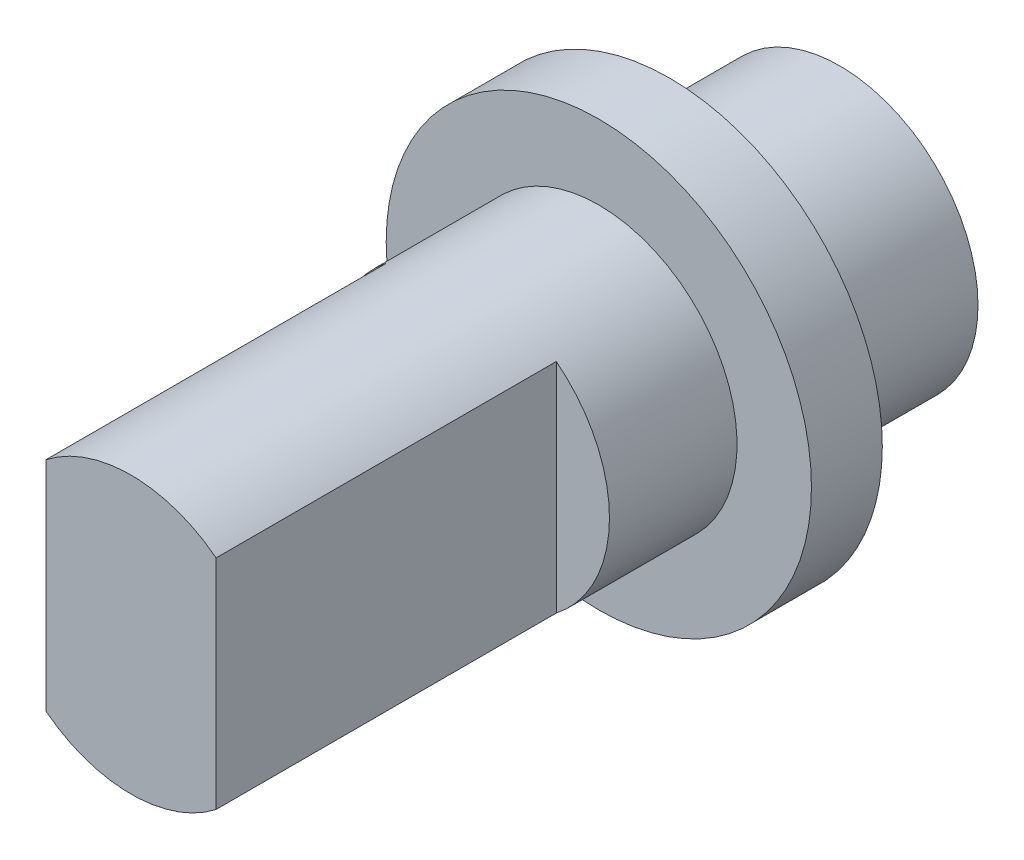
ISO-10303-21;
HEADER;
FILE_DESCRIPTION(('STEP AP214'),'2;1');
FILE_NAME('part.step','',(''),(''),'','','');
FILE_SCHEMA(('AUTOMOTIVE_DESIGN { 1 0 10303 214 1 1 1 1 }'));
ENDSEC;
DATA;
#1=APPLICATION_CONTEXT('core data for automotive mechanical design processes');
#2=APPLICATION_PROTOCOL_DEFINITION('international standard','automotive_design',2000,#1);
#3=PRODUCT_CONTEXT('',#1,'mechanical');
#4=PRODUCT('Part','Part','',(#3));
#5=PRODUCT_RELATED_PRODUCT_CATEGORY('part','',(#4));
#6=PRODUCT_DEFINITION_FORMATION('','',#4);
#7=PRODUCT_DEFINITION_CONTEXT('part definition',#1,'design');
#8=PRODUCT_DEFINITION('design','',#6,#7);
#9=PRODUCT_DEFINITION_SHAPE('','',#8);
#10=(LENGTH_UNIT() NAMED_UNIT(*) SI_UNIT(.MILLI.,.METRE.));
#11=(NAMED_UNIT(*) PLANE_ANGLE_UNIT() SI_UNIT($,.RADIAN.));
#12=(NAMED_UNIT(*) SI_UNIT($,.STERADIAN.) SOLID_ANGLE_UNIT());
#13=UNCERTAINTY_MEASURE_WITH_UNIT(LENGTH_MEASURE(1.E-05),#10,'distance_accuracy_value','');
#14=(GEOMETRIC_REPRESENTATION_CONTEXT(3) GLOBAL_UNCERTAINTY_ASSIGNED_CONTEXT((#13)) GLOBAL_UNIT_ASSIGNED_CONTEXT((#10,
#11,#12)) REPRESENTATION_CONTEXT('',''));
#15=CARTESIAN_POINT('',(0.,0.,0.));
#16=DIRECTION('',(0.,0.,1.));
#17=DIRECTION('',(1.,0.,0.));
#18=AXIS2_PLACEMENT_3D('',#15,#16,#17);
#19=CARTESIAN_POINT('',(0.,0.,12.7));
#20=DIRECTION('',(0.,0.,-1.));
#21=DIRECTION('',(-1.,0.,0.));
#22=AXIS2_PLACEMENT_3D('',#19,#20,#21);
#23=CYLINDRICAL_SURFACE('',#22,2.4765);
#24=CARTESIAN_POINT('',(0.,0.,12.7));
#25=DIRECTION('',(0.,0.,1.));
#26=DIRECTION('',(1.,0.,0.));
#27=AXIS2_PLACEMENT_3D('',#24,#25,#26);
#28=CIRCLE('',#27,2.4765);
#29=CARTESIAN_POINT('',(-1.524,-1.9520441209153,12.7));
#30=VERTEX_POINT('',#29);
#31=CARTESIAN_POINT('',(1.524,-1.9520441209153,12.7));
#32=VERTEX_POINT('',#31);
#33=EDGE_CURVE('E88',#30,#32,#28,.T.);
#34=ORIENTED_EDGE('',*,*,#33,.F.);
#35=DIRECTION('',(0.,0.,-1.));
#36=VECTOR('',#35,1.);
#37=CARTESIAN_POINT('',(-1.524,-1.9520441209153,12.7));
#38=LINE('',#37,#36);
#39=CARTESIAN_POINT('',(-1.524,-1.9520441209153,6.604));
#40=VERTEX_POINT('',#39);
#41=EDGE_CURVE('E47',#30,#40,#38,.T.);
#42=ORIENTED_EDGE('',*,*,#41,.T.);
#43=CARTESIAN_POINT('',(0.,0.,6.604));
#44=DIRECTION('',(0.,0.,1.));
#45=DIRECTION('',(1.,0.,0.));
#46=AXIS2_PLACEMENT_3D('',#43,#44,#45);
#47=CIRCLE('',#46,2.4765);
#48=CARTESIAN_POINT('',(-1.524,1.9520441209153,6.604));
#49=VERTEX_POINT('',#48);
#50=EDGE_CURVE('E102',#49,#40,#47,.T.);
#51=ORIENTED_EDGE('',*,*,#50,.F.);
#52=DIRECTION('',(0.,0.,-1.));
#53=VECTOR('',#52,1.);
#54=CARTESIAN_POINT('',(-1.524,1.9520441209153,12.7));
#55=LINE('',#54,#53);
#56=CARTESIAN_POINT('',(-1.524,1.9520441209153,12.7));
#57=VERTEX_POINT('',#56);
#58=EDGE_CURVE('E221',#49,#57,#55,.F.);
#59=ORIENTED_EDGE('',*,*,#58,.T.);
#60=CARTESIAN_POINT('',(1.524,1.9520441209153,12.7));
#61=VERTEX_POINT('',#60);
#62=EDGE_CURVE('E82',#61,#57,#28,.T.);
#63=ORIENTED_EDGE('',*,*,#62,.F.);
#64=DIRECTION('',(0.,0.,-1.));
#65=VECTOR('',#64,1.);
#66=CARTESIAN_POINT('',(1.524,1.9520441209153,12.7));
#67=LINE('',#66,#65);
#68=CARTESIAN_POINT('',(1.524,1.9520441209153,6.604));
#69=VERTEX_POINT('',#68);
#70=EDGE_CURVE('E55',#61,#69,#67,.T.);
#71=ORIENTED_EDGE('',*,*,#70,.T.);
#72=CARTESIAN_POINT('',(0.,0.,6.604));
#73=DIRECTION('',(0.,0.,1.));
#74=DIRECTION('',(1.,0.,0.));
#75=AXIS2_PLACEMENT_3D('',#72,#73,#74);
#76=CIRCLE('',#75,2.4765);
#77=CARTESIAN_POINT('',(1.524,-1.9520441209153,6.604));
#78=VERTEX_POINT('',#77);
#79=EDGE_CURVE('E89',#78,#69,#76,.T.);
#80=ORIENTED_EDGE('',*,*,#79,.F.);
#81=DIRECTION('',(0.,0.,-1.));
#82=VECTOR('',#81,1.);
#83=CARTESIAN_POINT('',(1.524,-1.9520441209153,12.7));
#84=LINE('',#83,#82);
#85=EDGE_CURVE('E75',#78,#32,#84,.F.);
#86=ORIENTED_EDGE('',*,*,#85,.T.);
#87=EDGE_LOOP('',(#34,#42,#51,#59,#63,#71,#80,#86));
#88=FACE_BOUND('',#87,.T.);
#89=CARTESIAN_POINT('',(0.,0.,4.318));
#90=DIRECTION('',(0.,0.,-1.));
#91=DIRECTION('',(0.,1.,0.));
#92=AXIS2_PLACEMENT_3D('',#89,#90,#91);
#93=CIRCLE('',#92,2.4765);
#94=CARTESIAN_POINT('',(0.,2.4765,4.318));
#95=VERTEX_POINT('',#94);
#96=EDGE_CURVE('E11',#95,#95,#93,.T.);
#97=ORIENTED_EDGE('',*,*,#96,.F.);
#98=EDGE_LOOP('',(#97));
#99=FACE_BOUND('',#98,.T.);
#100=ADVANCED_FACE('F33',(#88,#99),#23,.T.);
#101=CARTESIAN_POINT('',(0.,0.,12.7));
#102=DIRECTION('',(0.,0.,1.));
#103=DIRECTION('',(1.,0.,0.));
#104=AXIS2_PLACEMENT_3D('',#101,#102,#103);
#105=PLANE('',#104);
#106=DIRECTION('',(0.,1.,0.));
#107=VECTOR('',#106,1.);
#108=CARTESIAN_POINT('',(-1.524,0.,12.7));
#109=LINE('',#108,#107);
#110=EDGE_CURVE('E81',#30,#57,#109,.T.);
#111=ORIENTED_EDGE('',*,*,#110,.F.);
#112=ORIENTED_EDGE('',*,*,#33,.T.);
#113=DIRECTION('',(0.,-1.,0.));
#114=VECTOR('',#113,1.);
#115=CARTESIAN_POINT('',(1.524,0.,12.7));
#116=LINE('',#115,#114);
#117=EDGE_CURVE('E72',#61,#32,#116,.T.);
#118=ORIENTED_EDGE('',*,*,#117,.F.);
#119=ORIENTED_EDGE('',*,*,#62,.T.);
#120=EDGE_LOOP('',(#111,#112,#118,#119));
#121=FACE_BOUND('',#120,.T.);
#122=ADVANCED_FACE('F92',(#121),#105,.T.);
#123=CARTESIAN_POINT('',(0.,0.,6.604));
#124=DIRECTION('',(0.,0.,1.));
#125=DIRECTION('',(1.,0.,0.));
#126=AXIS2_PLACEMENT_3D('',#123,#124,#125);
#127=PLANE('',#126);
#128=ORIENTED_EDGE('',*,*,#79,.T.);
#129=DIRECTION('',(0.,-1.,0.));
#130=VECTOR('',#129,1.);
#131=CARTESIAN_POINT('',(1.524,2.1406151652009,6.604));
#132=LINE('',#131,#130);
#133=EDGE_CURVE('E215',#69,#78,#132,.T.);
#134=ORIENTED_EDGE('',*,*,#133,.T.);
#135=EDGE_LOOP('',(#128,#134));
#136=FACE_BOUND('',#135,.T.);
#137=ADVANCED_FACE('F124',(#136),#127,.T.);
#138=CARTESIAN_POINT('',(1.524,2.1406151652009,6.604));
#139=DIRECTION('',(-1.,0.,0.));
#140=DIRECTION('',(0.,-1.,0.));
#141=AXIS2_PLACEMENT_3D('',#138,#139,#140);
#142=PLANE('',#141);
#143=ORIENTED_EDGE('',*,*,#117,.T.);
#144=ORIENTED_EDGE('',*,*,#85,.F.);
#145=ORIENTED_EDGE('',*,*,#133,.F.);
#146=ORIENTED_EDGE('',*,*,#70,.F.);
#147=EDGE_LOOP('',(#143,#144,#145,#146));
#148=FACE_BOUND('',#147,.T.);
#149=ADVANCED_FACE('F74',(#148),#142,.F.);
#150=CARTESIAN_POINT('',(0.,0.,6.604));
#151=DIRECTION('',(0.,0.,1.));
#152=DIRECTION('',(1.,0.,0.));
#153=AXIS2_PLACEMENT_3D('',#150,#151,#152);
#154=PLANE('',#153);
#155=ORIENTED_EDGE('',*,*,#50,.T.);
#156=DIRECTION('',(0.,1.,0.));
#157=VECTOR('',#156,1.);
#158=CARTESIAN_POINT('',(-1.524,2.1406151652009,6.604));
#159=LINE('',#158,#157);
#160=EDGE_CURVE('E90',#40,#49,#159,.T.);
#161=ORIENTED_EDGE('',*,*,#160,.T.);
#162=EDGE_LOOP('',(#155,#161));
#163=FACE_BOUND('',#162,.T.);
#164=ADVANCED_FACE('F133',(#163),#154,.T.);
#165=CARTESIAN_POINT('',(-1.524,2.1406151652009,6.604));
#166=DIRECTION('',(1.,0.,0.));
#167=DIRECTION('',(0.,1.,0.));
#168=AXIS2_PLACEMENT_3D('',#165,#166,#167);
#169=PLANE('',#168);
#170=ORIENTED_EDGE('',*,*,#110,.T.);
#171=ORIENTED_EDGE('',*,*,#58,.F.);
#172=ORIENTED_EDGE('',*,*,#160,.F.);
#173=ORIENTED_EDGE('',*,*,#41,.F.);
#174=EDGE_LOOP('',(#170,#171,#172,#173));
#175=FACE_BOUND('',#174,.T.);
#176=ADVANCED_FACE('F135',(#175),#169,.F.);
#177=CARTESIAN_POINT('',(0.,0.,4.318));
#178=DIRECTION('',(0.,0.,-1.));
#179=DIRECTION('',(0.,1.,0.));
#180=AXIS2_PLACEMENT_3D('',#177,#178,#179);
#181=PLANE('',#180);
#182=ORIENTED_EDGE('',*,*,#96,.T.);
#183=EDGE_LOOP('',(#182));
#184=FACE_BOUND('',#183,.T.);
#185=CARTESIAN_POINT('',(0.,0.,4.318));
#186=DIRECTION('',(0.,0.,1.));
#187=DIRECTION('',(0.,-1.,0.));
#188=AXIS2_PLACEMENT_3D('',#185,#186,#187);
#189=CIRCLE('',#188,3.81);
#190=CARTESIAN_POINT('',(0.,-3.81,4.318));
#191=VERTEX_POINT('',#190);
#192=EDGE_CURVE('E210',#191,#191,#189,.T.);
#193=ORIENTED_EDGE('',*,*,#192,.T.);
#194=EDGE_LOOP('',(#193));
#195=FACE_BOUND('',#194,.T.);
#196=ADVANCED_FACE('F138',(#184,#195),#181,.F.);
#197=CARTESIAN_POINT('',(0.,0.,14.278296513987));
#198=DIRECTION('',(0.,0.,1.));
#199=DIRECTION('',(0.,-1.,0.));
#200=AXIS2_PLACEMENT_3D('',#197,#198,#199);
#201=CYLINDRICAL_SURFACE('',#200,3.81);
#202=ORIENTED_EDGE('',*,*,#192,.F.);
#203=EDGE_LOOP('',(#202));
#204=FACE_BOUND('',#203,.T.);
#205=CARTESIAN_POINT('',(0.,0.,3.048));
#206=DIRECTION('',(0.,0.,1.));
#207=DIRECTION('',(0.,-1.,0.));
#208=AXIS2_PLACEMENT_3D('',#205,#206,#207);
#209=CIRCLE('',#208,3.81);
#210=CARTESIAN_POINT('',(0.,-3.81,3.048));
#211=VERTEX_POINT('',#210);
#212=EDGE_CURVE('E213',#211,#211,#209,.T.);
#213=ORIENTED_EDGE('',*,*,#212,.T.);
#214=EDGE_LOOP('',(#213));
#215=FACE_BOUND('',#214,.T.);
#216=ADVANCED_FACE('F144',(#204,#215),#201,.T.);
#217=CARTESIAN_POINT('',(0.,0.,3.048));
#218=DIRECTION('',(0.,0.,1.));
#219=DIRECTION('',(0.,-1.,0.));
#220=AXIS2_PLACEMENT_3D('',#217,#218,#219);
#221=PLANE('',#220);
#222=CARTESIAN_POINT('',(0.,0.,3.048));
#223=DIRECTION('',(0.,0.,1.));
#224=DIRECTION('',(0.,-1.,0.));
#225=AXIS2_PLACEMENT_3D('',#222,#223,#224);
#226=CIRCLE('',#225,2.4765);
#227=CARTESIAN_POINT('',(0.,-2.4765,3.048));
#228=VERTEX_POINT('',#227);
#229=EDGE_CURVE('E40',#228,#228,#226,.T.);
#230=ORIENTED_EDGE('',*,*,#229,.T.);
#231=EDGE_LOOP('',(#230));
#232=FACE_BOUND('',#231,.T.);
#233=ORIENTED_EDGE('',*,*,#212,.F.);
#234=EDGE_LOOP('',(#233));
#235=FACE_BOUND('',#234,.T.);
#236=ADVANCED_FACE('F106',(#232,#235),#221,.F.);
#237=CARTESIAN_POINT('',(0.,0.,0.));
#238=DIRECTION('',(0.,0.,1.));
#239=DIRECTION('',(1.,0.,0.));
#240=AXIS2_PLACEMENT_3D('',#237,#238,#239);
#241=PLANE('',#240);
#242=CARTESIAN_POINT('',(0.,0.,0.));
#243=DIRECTION('',(0.,0.,1.));
#244=DIRECTION('',(1.,0.,0.));
#245=AXIS2_PLACEMENT_3D('',#242,#243,#244);
#246=CIRCLE('',#245,2.4765);
#247=CARTESIAN_POINT('',(2.4765,0.,0.));
#248=VERTEX_POINT('',#247);
#249=EDGE_CURVE('E93',#248,#248,#246,.T.);
#250=ORIENTED_EDGE('',*,*,#249,.F.);
#251=EDGE_LOOP('',(#250));
#252=FACE_BOUND('',#251,.T.);
#253=ADVANCED_FACE('F111',(#252),#241,.F.);
#254=ORIENTED_EDGE('',*,*,#249,.T.);
#255=EDGE_LOOP('',(#254));
#256=FACE_BOUND('',#255,.T.);
#257=ORIENTED_EDGE('',*,*,#229,.F.);
#258=EDGE_LOOP('',(#257));
#259=FACE_BOUND('',#258,.T.);
#260=ADVANCED_FACE('F109',(#256,#259),#23,.T.);
#261=CLOSED_SHELL('',(#100,#122,#137,#149,#164,#176,#196,#216,#236,#253,#260));
#262=MANIFOLD_SOLID_BREP('B2',#261);
#263=ADVANCED_BREP_SHAPE_REPRESENTATION('',(#18,#262),#14);
#264=SHAPE_DEFINITION_REPRESENTATION(#9,#263);
ENDSEC;
END-ISO-10303-21;
